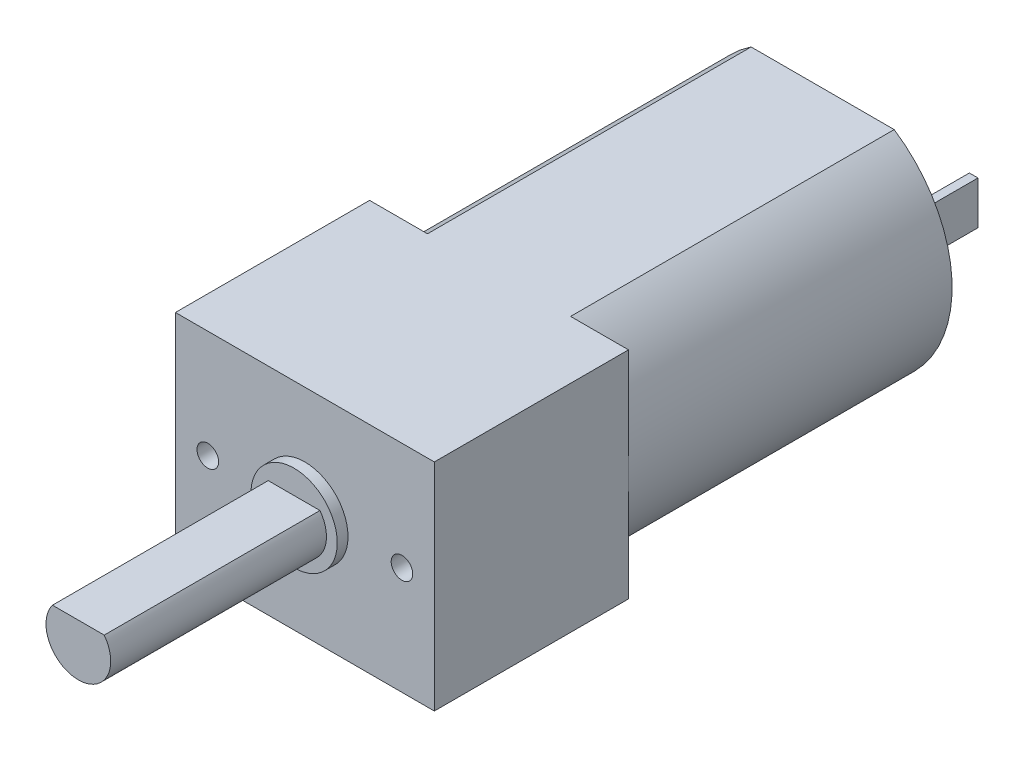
from build123d import *

# Parameters (mm, degrees)
SKIZZE1_W                       = 12
SKIZZE1_H                       = 10
SKIZZE1_R                       = 0.5
AUFSATZ_LINEAR_AUSTRAGEN1_DEPTH = 9
SKIZZE2_R                       = 2
AUFSATZ_LINEAR_AUSTRAGEN2_DEPTH = 0.5
AUFSATZ_LINEAR_AUSTRAGEN3_DEPTH = 10
AUFSATZ_LINEAR_AUSTRAGEN4_DEPTH = 15
SKIZZE5_W                       = 0.4
SKIZZE5_H                       = 2
AUFSATZ_LINEAR_AUSTRAGEN5_DEPTH = 4


with BuildPart() as part:
    # Skizze1 → Aufsatz-Linear austragen1 (new body)
    with BuildSketch(Plane.XY):
        Rectangle(SKIZZE1_W, SKIZZE1_H)
        with Locations((-4.5, 0)):
            Circle(SKIZZE1_R, mode=Mode.SUBTRACT)
        with Locations((4.5, 0)):
            Circle(SKIZZE1_R, mode=Mode.SUBTRACT)
    extrude(amount=AUFSATZ_LINEAR_AUSTRAGEN1_DEPTH)

    # Skizze2 → Aufsatz-Linear austragen2 (add)
    with BuildSketch(Plane.XY.offset(9)):
        Circle(SKIZZE2_R)
    extrude(amount=AUFSATZ_LINEAR_AUSTRAGEN2_DEPTH)

    # Skizze4 → Aufsatz-Linear austragen4 (add)
    with BuildSketch(Plane(origin=(0, 0, 0), x_dir=(-1, 0, 0), z_dir=(0, 0, -1))):
        with BuildLine():
            Line((-3.31662479, 5), (3.31662479, 5))
            ThreePointArc((3.31662479, 5), (6, 0), (3.31662479, -5))
            Line((3.31662479, -5), (-3.31662479, -5))
            ThreePointArc((-3.31662479, -5), (-6, 0), (-3.31662479, 5))
        make_face()
    extrude(amount=AUFSATZ_LINEAR_AUSTRAGEN4_DEPTH)

    # Skizze5 → Aufsatz-Linear austragen5 (add)
    with BuildSketch(Plane(origin=(0, 0, -15), x_dir=(-1, 0, 0), z_dir=(0, 0, -1))):
        with Locations((-3, 0)):
            Rectangle(SKIZZE5_W, SKIZZE5_H)
        with Locations((3, 0)):
            Rectangle(SKIZZE5_W, SKIZZE5_H)
    extrude(amount=AUFSATZ_LINEAR_AUSTRAGEN5_DEPTH)


with BuildPart() as body_2:
    # Skizze3 → Aufsatz-Linear austragen3 (new body)
    with BuildSketch(Plane.XY.offset(9.5)):
        with BuildLine():
            Line((-1.2, 0.9), (1.2, 0.9))
            ThreePointArc((1.2, 0.9), (0, -1.5), (-1.2, 0.9))
        make_face()
    extrude(amount=AUFSATZ_LINEAR_AUSTRAGEN3_DEPTH)


solid = Compound([part.part, body_2.part])
